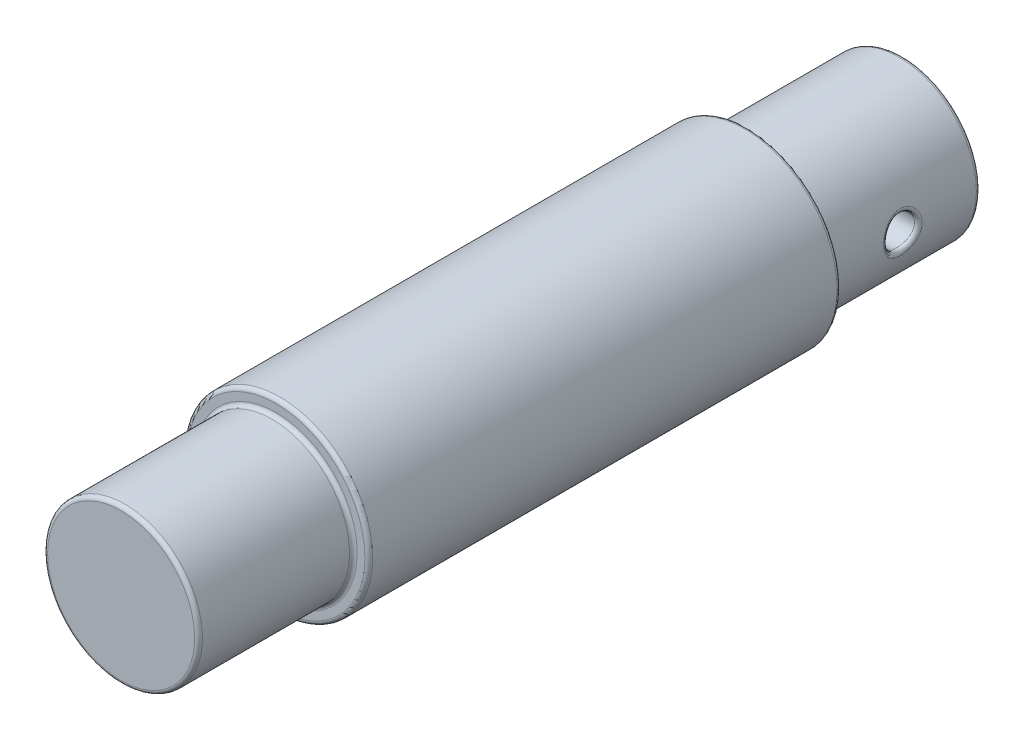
from build123d import *

# Parameters (mm, degrees)
SKETCH_2_R          = 2
CUT_EXTRUDE_1_DEPTH = 10
FILLET_1_R          = 0.5


with BuildPart() as part:
    # Sketch 1 → Revolve 1 (revolve)
    with BuildSketch(Plane(origin=(0, 0, 0), x_dir=(0, 0, -1), z_dir=(1, 0, 0)), mode=Mode.PRIVATE) as revolve_1_sk:
        Polygon((-50.5, 0), (50.5, 0), (50.5, 10), (30.5, 10), (30.5, 12), (-30.5, 12), (-30.5, 10), (-50.5, 10), align=None)
    revolve(revolve_1_sk.sketch.rotate(Axis((0, 0, 50.5), (0, 0, -1)), 90), axis=Axis((0, 0, 50.5), (0, 0, -1)))

    # Sketch 2 → Cut-Extrude 1 (cut, symmetric)
    with BuildSketch(Plane(origin=(0, 0, 0), x_dir=(0, 0, -1), z_dir=(1, 0, 0))):
        with Locations((40.5, 0)):
            Circle(SKETCH_2_R)
    extrude(amount=CUT_EXTRUDE_1_DEPTH, both=True, mode=Mode.SUBTRACT)

    # Fillet 1
    fillet_1_edges = [part.edges().sort_by_distance(p)[0] for p in [
        (9.797958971, 2, -40.5),
        (-10.000000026, 1e-09, -38.500000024),
        (-10, 0, -50.5),
        (-10, 0, -30.5),
        (-12, 0, -30.5),
        (-12, 0, 30.5),
        (-10, 0, 30.5),
        (-10, 0, 50.5),
    ]]
    fillet(fillet_1_edges, radius=FILLET_1_R)


solid = part.part
